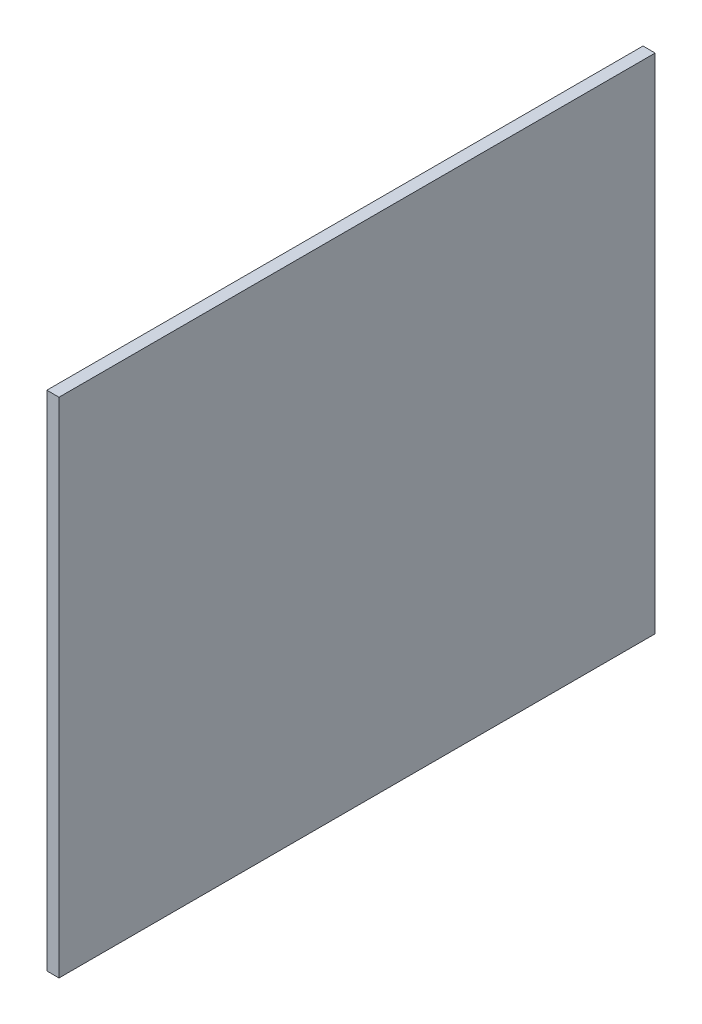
from build123d import *

# Parameters (mm, degrees)
SKETCH1_W          = 999.998
SKETCH1_H          = 525.018
EXTRUDE1_DEPTH     = 12.7
SKETCH2_W          = 513.713523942
SKETCH2_H          = 640.04633694
CUT_EXTRUDE1_DEPTH = 1130.513696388


with BuildPart() as part:
    # Sketch1 → Extrude1 (new body)
    with BuildSketch(Plane(origin=(0, 0, 0), x_dir=(0, 0, -1), z_dir=(1, 0, 0))):
        with Locations((499.999, 262.509)):
            Rectangle(SKETCH1_W, SKETCH1_H)
    extrude(amount=EXTRUDE1_DEPTH)

    # Sketch2 → Cut-Extrude1 (cut, through all)
    with BuildSketch(Plane(origin=(12.7, 0, 0), x_dir=(0, 0, -1), z_dir=(1, 0, 0))):
        with Locations((879.156761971, 270.591905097)):
            Rectangle(SKETCH2_W, SKETCH2_H)
    extrude(amount=-CUT_EXTRUDE1_DEPTH, mode=Mode.SUBTRACT)


solid = part.part
